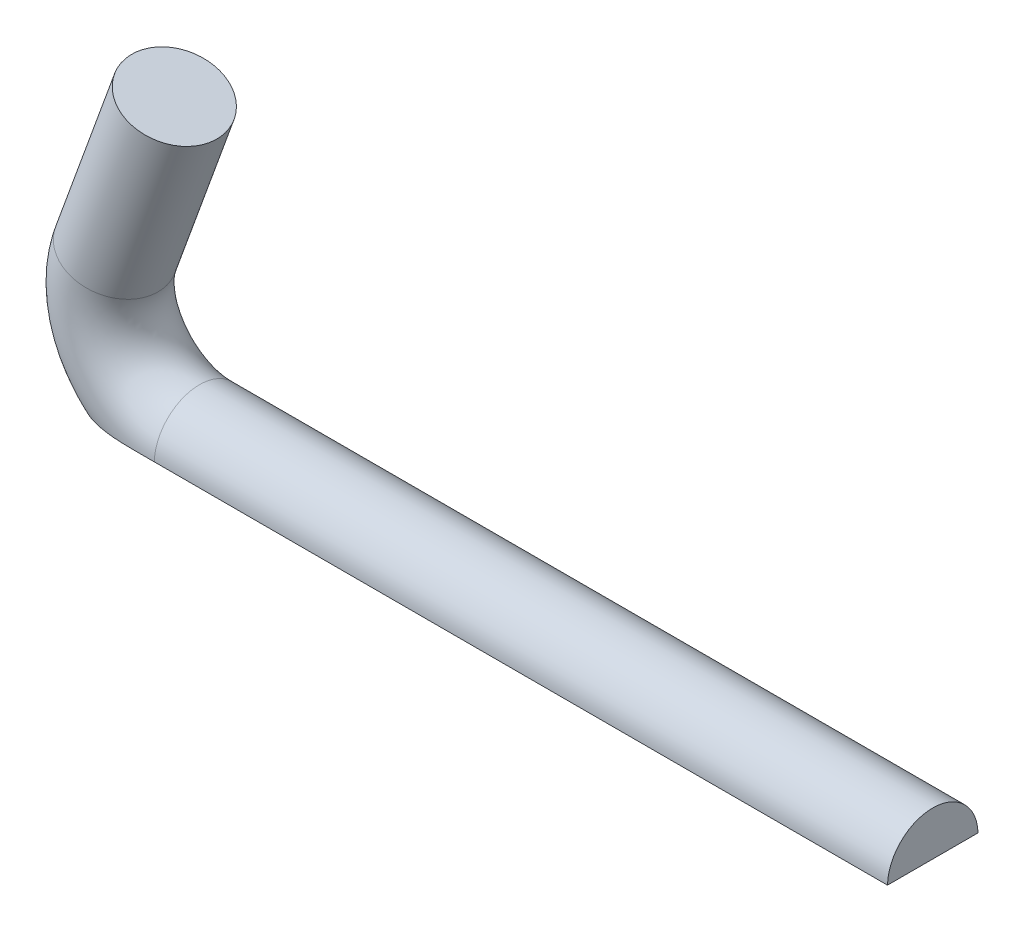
ISO-10303-21;
HEADER;
FILE_DESCRIPTION(('STEP AP214'),'2;1');
FILE_NAME('part.step','',(''),(''),'','','');
FILE_SCHEMA(('AUTOMOTIVE_DESIGN { 1 0 10303 214 1 1 1 1 }'));
ENDSEC;
DATA;
#1=APPLICATION_CONTEXT('core data for automotive mechanical design processes');
#2=APPLICATION_PROTOCOL_DEFINITION('international standard','automotive_design',2000,#1);
#3=PRODUCT_CONTEXT('',#1,'mechanical');
#4=PRODUCT('Part','Part','',(#3));
#5=PRODUCT_RELATED_PRODUCT_CATEGORY('part','',(#4));
#6=PRODUCT_DEFINITION_FORMATION('','',#4);
#7=PRODUCT_DEFINITION_CONTEXT('part definition',#1,'design');
#8=PRODUCT_DEFINITION('design','',#6,#7);
#9=PRODUCT_DEFINITION_SHAPE('','',#8);
#10=(LENGTH_UNIT() NAMED_UNIT(*) SI_UNIT(.MILLI.,.METRE.));
#11=(NAMED_UNIT(*) PLANE_ANGLE_UNIT() SI_UNIT($,.RADIAN.));
#12=(NAMED_UNIT(*) SI_UNIT($,.STERADIAN.) SOLID_ANGLE_UNIT());
#13=UNCERTAINTY_MEASURE_WITH_UNIT(LENGTH_MEASURE(1.E-05),#10,'distance_accuracy_value','');
#14=(GEOMETRIC_REPRESENTATION_CONTEXT(3) GLOBAL_UNCERTAINTY_ASSIGNED_CONTEXT((#13)) GLOBAL_UNIT_ASSIGNED_CONTEXT((#10,
#11,#12)) REPRESENTATION_CONTEXT('',''));
#15=CARTESIAN_POINT('',(0.,0.,0.));
#16=DIRECTION('',(0.,0.,1.));
#17=DIRECTION('',(1.,0.,0.));
#18=AXIS2_PLACEMENT_3D('',#15,#16,#17);
#19=CARTESIAN_POINT('',(0.,0.,0.));
#20=DIRECTION('',(1.,0.,0.));
#21=DIRECTION('',(0.,0.,-1.));
#22=AXIS2_PLACEMENT_3D('',#19,#20,#21);
#23=PLANE('',#22);
#24=DIRECTION('',(0.,0.,1.));
#25=VECTOR('',#24,1.);
#26=CARTESIAN_POINT('',(0.,0.0253999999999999,-1.1684));
#27=LINE('',#26,#25);
#28=CARTESIAN_POINT('',(0.,0.0253999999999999,-1.1681238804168));
#29=VERTEX_POINT('',#28);
#30=CARTESIAN_POINT('',(0.,0.0253999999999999,1.1681238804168));
#31=VERTEX_POINT('',#30);
#32=EDGE_CURVE('E71',#29,#31,#27,.T.);
#33=ORIENTED_EDGE('',*,*,#32,.F.);
#34=CARTESIAN_POINT('',(0.,0.,0.));
#35=DIRECTION('',(1.,0.,0.));
#36=DIRECTION('',(0.,0.,-1.));
#37=AXIS2_PLACEMENT_3D('',#34,#35,#36);
#38=CIRCLE('',#37,1.1684);
#39=EDGE_CURVE('E76',#29,#31,#38,.T.);
#40=ORIENTED_EDGE('',*,*,#39,.T.);
#41=EDGE_LOOP('',(#33,#40));
#42=FACE_BOUND('',#41,.T.);
#43=ADVANCED_FACE('F37',(#42),#23,.T.);
#44=CARTESIAN_POINT('',(-19.575369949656,7.27979873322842,0.));
#45=DIRECTION('',(-0.342020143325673,-0.939692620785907,0.));
#46=DIRECTION('',(0.,0.,-1.));
#47=AXIS2_PLACEMENT_3D('',#44,#45,#46);
#48=PLANE('',#47);
#49=CARTESIAN_POINT('',(-19.575369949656,7.27979873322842,0.));
#50=DIRECTION('',(-0.342020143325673,-0.939692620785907,0.));
#51=DIRECTION('',(0.,0.,-1.));
#52=AXIS2_PLACEMENT_3D('',#49,#50,#51);
#53=CIRCLE('',#52,1.1684);
#54=CARTESIAN_POINT('',(-19.575369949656,7.27979873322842,-1.1684));
#55=VERTEX_POINT('',#54);
#56=EDGE_CURVE('E49',#55,#55,#53,.T.);
#57=ORIENTED_EDGE('',*,*,#56,.F.);
#58=EDGE_LOOP('',(#57));
#59=FACE_BOUND('',#58,.T.);
#60=ADVANCED_FACE('F103',(#59),#48,.F.);
#61=CARTESIAN_POINT('',(0.,0.,0.));
#62=DIRECTION('',(-1.,0.,0.));
#63=DIRECTION('',(0.,-1.,0.));
#64=AXIS2_PLACEMENT_3D('',#61,#62,#63);
#65=CYLINDRICAL_SURFACE('',#64,1.1684);
#66=ORIENTED_EDGE('',*,*,#39,.F.);
#67=DIRECTION('',(-1.,0.,0.));
#68=VECTOR('',#67,1.);
#69=CARTESIAN_POINT('',(0.,0.0253999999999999,-1.1681238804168));
#70=LINE('',#69,#68);
#71=CARTESIAN_POINT('',(-18.9239786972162,0.0253999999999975,-1.1681238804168));
#72=VERTEX_POINT('',#71);
#73=EDGE_CURVE('E68',#29,#72,#70,.T.);
#74=ORIENTED_EDGE('',*,*,#73,.T.);
#75=CARTESIAN_POINT('',(-18.9239786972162,0.,0.));
#76=DIRECTION('',(1.,0.,0.));
#77=DIRECTION('',(0.,0.,-1.));
#78=AXIS2_PLACEMENT_3D('',#75,#76,#77);
#79=CIRCLE('',#78,1.1684);
#80=CARTESIAN_POINT('',(-18.9239786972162,0.0253999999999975,1.1681238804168));
#81=VERTEX_POINT('',#80);
#82=EDGE_CURVE('E83',#72,#81,#79,.T.);
#83=ORIENTED_EDGE('',*,*,#82,.T.);
#84=DIRECTION('',(-1.,0.,0.));
#85=VECTOR('',#84,1.);
#86=CARTESIAN_POINT('',(0.,0.0253999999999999,1.1681238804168));
#87=LINE('',#86,#85);
#88=EDGE_CURVE('E77',#81,#31,#87,.F.);
#89=ORIENTED_EDGE('',*,*,#88,.T.);
#90=EDGE_LOOP('',(#66,#74,#83,#89));
#91=FACE_BOUND('',#90,.T.);
#92=ADVANCED_FACE('F82',(#91),#65,.T.);
#93=CARTESIAN_POINT('',(-18.9239786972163,2.3114,0.));
#94=DIRECTION('',(0.,0.,-1.));
#95=DIRECTION('',(-1.,0.,0.));
#96=AXIS2_PLACEMENT_3D('',#93,#94,#95);
#97=TOROIDAL_SURFACE('',#96,2.3114,1.1684);
#98=CARTESIAN_POINT('',(-21.0959842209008,3.10194535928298,0.));
#99=DIRECTION('',(-0.342020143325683,-0.939692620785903,0.));
#100=DIRECTION('',(0.,0.,-1.));
#101=AXIS2_PLACEMENT_3D('',#98,#99,#100);
#102=CIRCLE('',#101,1.1684);
#103=CARTESIAN_POINT('',(-21.0959842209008,3.10194535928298,-1.1684));
#104=VERTEX_POINT('',#103);
#105=EDGE_CURVE('E85',#104,#104,#102,.T.);
#106=ORIENTED_EDGE('',*,*,#105,.T.);
#107=EDGE_LOOP('',(#106));
#108=FACE_BOUND('',#107,.T.);
#109=CARTESIAN_POINT('',(-21.5475663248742,0.0253999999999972,0.));
#110=CARTESIAN_POINT('',(-21.5475617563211,0.0253999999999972,0.0527999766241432));
#111=CARTESIAN_POINT('',(-21.5427870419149,0.0253999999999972,0.105663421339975));
#112=CARTESIAN_POINT('',(-21.5239475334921,0.0253999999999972,0.209757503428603));
#113=CARTESIAN_POINT('',(-21.5098658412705,0.0253999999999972,0.260984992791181));
#114=CARTESIAN_POINT('',(-21.4732770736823,0.0253999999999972,0.36007078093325));
#115=CARTESIAN_POINT('',(-21.4508056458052,0.0253999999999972,0.407942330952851));
#116=CARTESIAN_POINT('',(-21.3985605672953,0.0253999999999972,0.499460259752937));
#117=CARTESIAN_POINT('',(-21.3687884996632,0.0253999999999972,0.543107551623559));
#118=CARTESIAN_POINT('',(-21.3014399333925,0.0253999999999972,0.627748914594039));
#119=CARTESIAN_POINT('',(-21.263531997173,0.0253999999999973,0.668477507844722));
#120=CARTESIAN_POINT('',(-21.1824267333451,0.0253999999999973,0.744263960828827));
#121=CARTESIAN_POINT('',(-21.1392249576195,0.0253999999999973,0.779316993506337));
#122=CARTESIAN_POINT('',(-21.0227333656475,0.0253999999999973,0.862376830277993));
#123=CARTESIAN_POINT('',(-20.9464556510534,0.0253999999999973,0.906202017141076));
#124=CARTESIAN_POINT('',(-20.7880497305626,0.0253999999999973,0.981128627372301));
#125=CARTESIAN_POINT('',(-20.7059165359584,0.0253999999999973,1.01221904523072));
#126=CARTESIAN_POINT('',(-20.5306451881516,0.0253999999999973,1.06622481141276));
#127=CARTESIAN_POINT('',(-20.4371967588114,0.0253999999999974,1.08810187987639));
#128=CARTESIAN_POINT('',(-20.2485093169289,0.0253999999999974,1.12224845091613));
#129=CARTESIAN_POINT('',(-20.1532673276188,0.0253999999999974,1.13450021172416));
#130=CARTESIAN_POINT('',(-19.9615072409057,0.0253999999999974,1.15240707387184));
#131=CARTESIAN_POINT('',(-19.8649849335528,0.0253999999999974,1.15801185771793));
#132=CARTESIAN_POINT('',(-19.6718912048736,0.0253999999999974,1.16524995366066));
#133=CARTESIAN_POINT('',(-19.5753198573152,0.0253999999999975,1.16688586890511));
#134=CARTESIAN_POINT('',(-19.4079817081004,0.0253999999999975,1.16826550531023));
#135=CARTESIAN_POINT('',(-19.3372156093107,0.0253999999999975,1.16839805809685));
#136=CARTESIAN_POINT('',(-19.1956830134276,0.0253999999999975,1.16840193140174));
#137=CARTESIAN_POINT('',(-19.1249165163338,0.0253999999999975,1.16827325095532));
#138=CARTESIAN_POINT('',(-18.9833454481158,0.0253999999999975,1.168123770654));
#139=CARTESIAN_POINT('',(-18.9125408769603,0.0253999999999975,1.16810302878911));
#140=CARTESIAN_POINT('',(-18.7709321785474,0.0253999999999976,1.16820717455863));
#141=CARTESIAN_POINT('',(-18.7001280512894,0.0253999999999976,1.16833206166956));
#142=CARTESIAN_POINT('',(-18.5586114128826,0.0253999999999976,1.16843184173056));
#143=CARTESIAN_POINT('',(-18.4878989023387,0.0253999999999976,1.16840692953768));
#144=CARTESIAN_POINT('',(-18.3464724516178,0.0253999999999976,1.16761737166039));
#145=CARTESIAN_POINT('',(-18.2757585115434,0.0253999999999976,1.16685268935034));
#146=CARTESIAN_POINT('',(-18.1344279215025,0.0253999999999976,1.16375971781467));
#147=CARTESIAN_POINT('',(-18.0638112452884,0.0253999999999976,1.1614330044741));
#148=CARTESIAN_POINT('',(-17.9227124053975,0.0253999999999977,1.15422770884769));
#149=CARTESIAN_POINT('',(-17.8522302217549,0.0253999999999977,1.14934954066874));
#150=CARTESIAN_POINT('',(-17.7099750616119,0.0253999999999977,1.13576916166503));
#151=CARTESIAN_POINT('',(-17.6382091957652,0.0253999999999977,1.12698248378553));
#152=CARTESIAN_POINT('',(-17.4955011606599,0.0253999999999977,1.10432711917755));
#153=CARTESIAN_POINT('',(-17.4245593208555,0.0253999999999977,1.09045646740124));
#154=CARTESIAN_POINT('',(-17.2150488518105,0.0253999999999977,1.03941436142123));
#155=CARTESIAN_POINT('',(-17.0782930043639,0.0253999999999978,0.992727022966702));
#156=CARTESIAN_POINT('',(-16.8920633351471,0.0253999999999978,0.899859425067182));
#157=CARTESIAN_POINT('',(-16.8357366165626,0.0253999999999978,0.867348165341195));
#158=CARTESIAN_POINT('',(-16.7280938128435,0.0253999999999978,0.794595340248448));
#159=CARTESIAN_POINT('',(-16.6767852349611,0.0253999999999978,0.754342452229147));
#160=CARTESIAN_POINT('',(-16.5809280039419,0.0253999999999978,0.665614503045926));
#161=CARTESIAN_POINT('',(-16.5364405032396,0.0253999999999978,0.617072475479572));
#162=CARTESIAN_POINT('',(-16.4571958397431,0.0253999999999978,0.512589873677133));
#163=CARTESIAN_POINT('',(-16.4224268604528,0.0253999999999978,0.456658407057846));
#164=CARTESIAN_POINT('',(-16.3672585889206,0.0253999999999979,0.343599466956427));
#165=CARTESIAN_POINT('',(-16.3459295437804,0.0253999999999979,0.28692875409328));
#166=CARTESIAN_POINT('',(-16.3149567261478,0.0253999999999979,0.170472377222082));
#167=CARTESIAN_POINT('',(-16.3053035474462,0.0253999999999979,0.110689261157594));
#168=CARTESIAN_POINT('',(-16.2988919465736,0.0253999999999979,-0.000712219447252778));
#169=CARTESIAN_POINT('',(-16.3004475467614,0.0253999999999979,-0.0522398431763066));
#170=CARTESIAN_POINT('',(-16.312462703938,0.0253999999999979,-0.154231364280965));
#171=CARTESIAN_POINT('',(-16.3229195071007,0.0253999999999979,-0.204695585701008));
#172=CARTESIAN_POINT('',(-16.3517546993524,0.0253999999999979,-0.301752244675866));
#173=CARTESIAN_POINT('',(-16.3699047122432,0.0253999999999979,-0.348413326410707));
#174=CARTESIAN_POINT('',(-16.4132171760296,0.0253999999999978,-0.438336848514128));
#175=CARTESIAN_POINT('',(-16.4383806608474,0.0253999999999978,-0.481598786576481));
#176=CARTESIAN_POINT('',(-16.4969522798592,0.0253999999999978,-0.567311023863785));
#177=CARTESIAN_POINT('',(-16.5308593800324,0.0253999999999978,-0.609418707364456));
#178=CARTESIAN_POINT('',(-16.6043105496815,0.0253999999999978,-0.688369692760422));
#179=CARTESIAN_POINT('',(-16.6438585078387,0.0253999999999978,-0.725209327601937));
#180=CARTESIAN_POINT('',(-16.7484356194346,0.0253999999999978,-0.810758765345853));
#181=CARTESIAN_POINT('',(-16.8162497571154,0.0253999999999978,-0.856072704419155));
#182=CARTESIAN_POINT('',(-16.9582102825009,0.0253999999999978,-0.93521239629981));
#183=CARTESIAN_POINT('',(-17.0323667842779,0.0253999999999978,-0.969019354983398));
#184=CARTESIAN_POINT('',(-17.2313361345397,0.0253999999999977,-1.04440152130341));
#185=CARTESIAN_POINT('',(-17.3591624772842,0.0253999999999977,-1.07789073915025));
#186=CARTESIAN_POINT('',(-17.6182624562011,0.0253999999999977,-1.12642757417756));
#187=CARTESIAN_POINT('',(-17.7495480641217,0.0253999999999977,-1.14139912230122));
#188=CARTESIAN_POINT('',(-17.9800206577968,0.0253999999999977,-1.15811090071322));
#189=CARTESIAN_POINT('',(-18.0790721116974,0.0253999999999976,-1.16221543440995));
#190=CARTESIAN_POINT('',(-18.2772737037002,0.0253999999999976,-1.16714102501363));
#191=CARTESIAN_POINT('',(-18.376423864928,0.0253999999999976,-1.1679608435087));
#192=CARTESIAN_POINT('',(-18.5744799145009,0.0253999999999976,-1.16855606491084));
#193=CARTESIAN_POINT('',(-18.6733858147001,0.0253999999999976,-1.16833398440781));
#194=CARTESIAN_POINT('',(-18.8711787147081,0.0253999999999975,-1.16811077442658));
#195=CARTESIAN_POINT('',(-18.9700657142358,0.0253999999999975,-1.16810959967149));
#196=CARTESIAN_POINT('',(-19.1426669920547,0.0253999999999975,-1.1682930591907));
#197=CARTESIAN_POINT('',(-19.2163814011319,0.0253999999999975,-1.16843047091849));
#198=CARTESIAN_POINT('',(-19.3638096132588,0.0253999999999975,-1.16835760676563));
#199=CARTESIAN_POINT('',(-19.4375234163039,0.0253999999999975,-1.16814733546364));
#200=CARTESIAN_POINT('',(-19.5852228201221,0.0253999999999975,-1.16660853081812));
#201=CARTESIAN_POINT('',(-19.6592083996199,0.0253999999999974,-1.16527579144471));
#202=CARTESIAN_POINT('',(-19.8071095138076,0.0253999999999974,-1.16045526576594));
#203=CARTESIAN_POINT('',(-19.8810250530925,0.0253999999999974,-1.15696763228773));
#204=CARTESIAN_POINT('',(-20.0298655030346,0.0253999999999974,-1.14653758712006));
#205=CARTESIAN_POINT('',(-20.104787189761,0.0253999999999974,-1.13953969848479));
#206=CARTESIAN_POINT('',(-20.2540021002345,0.0253999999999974,-1.12069402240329));
#207=CARTESIAN_POINT('',(-20.3282950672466,0.0253999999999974,-1.10884434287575));
#208=CARTESIAN_POINT('',(-20.5484945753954,0.0253999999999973,-1.06390908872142));
#209=CARTESIAN_POINT('',(-20.6929835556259,0.0253999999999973,-1.02139954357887));
#210=CARTESIAN_POINT('',(-20.8914507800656,0.0253999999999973,-0.933509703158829));
#211=CARTESIAN_POINT('',(-20.9517493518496,0.0253999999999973,-0.902387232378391));
#212=CARTESIAN_POINT('',(-21.0675128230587,0.0253999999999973,-0.831926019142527));
#213=CARTESIAN_POINT('',(-21.1229736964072,0.0253999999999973,-0.792580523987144));
#214=CARTESIAN_POINT('',(-21.2273209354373,0.0253999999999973,-0.704919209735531));
#215=CARTESIAN_POINT('',(-21.2761382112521,0.0253999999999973,-0.65651997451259));
#216=CARTESIAN_POINT('',(-21.3638440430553,0.0253999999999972,-0.551396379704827));
#217=CARTESIAN_POINT('',(-21.4027472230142,0.0253999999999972,-0.494684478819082));
#218=CARTESIAN_POINT('',(-21.4600156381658,0.0253999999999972,-0.389012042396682));
#219=CARTESIAN_POINT('',(-21.481073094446,0.0253999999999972,-0.341501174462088));
#220=CARTESIAN_POINT('',(-21.5148999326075,0.0253999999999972,-0.243665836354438));
#221=CARTESIAN_POINT('',(-21.5276876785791,0.0253999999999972,-0.193347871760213));
#222=CARTESIAN_POINT('',(-21.5398492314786,0.0253999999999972,-0.118831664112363));
#223=CARTESIAN_POINT('',(-21.5427381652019,0.0253999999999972,-0.0951639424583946));
#224=CARTESIAN_POINT('',(-21.5465979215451,0.0253999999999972,-0.0476684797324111));
#225=CARTESIAN_POINT('',(-21.5475683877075,0.0253999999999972,-0.0238407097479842));
#226=CARTESIAN_POINT('',(-21.5475663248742,0.0253999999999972,0.));
#227=B_SPLINE_CURVE_WITH_KNOTS('',3,(#109,#110,#111,#112,#113,#114,#115,#116,#117,#118,#119,
#120,#121,#122,#123,#124,#125,#126,#127,#128,#129,#130,#131,#132,#133,#134,#135,#136,#137,#138,
#139,#140,#141,#142,#143,#144,#145,#146,#147,#148,#149,#150,#151,#152,#153,#154,#155,#156,#157,
#158,#159,#160,#161,#162,#163,#164,#165,#166,#167,#168,#169,#170,#171,#172,#173,#174,#175,#176,
#177,#178,#179,#180,#181,#182,#183,#184,#185,#186,#187,#188,#189,#190,#191,#192,#193,#194,#195,
#196,#197,#198,#199,#200,#201,#202,#203,#204,#205,#206,#207,#208,#209,#210,#211,#212,#213,#214,
#215,#216,#217,#218,#219,#220,#221,#222,#223,#224,#225,#226),.UNSPECIFIED.,.T.,.F.,(4,2,2,2,2,2,
2,2,2,2,2,2,2,2,2,2,2,2,2,2,2,2,2,2,2,2,2,2,2,2,2,2,2,2,2,2,2,2,2,2,2,2,2,2,2,2,2,2,2,2,2,2,2,2,
2,2,2,2,4),(0.,0.158300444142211,0.316889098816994,0.474811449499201,0.632699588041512,
0.799004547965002,0.965450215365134,1.22784885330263,1.49047378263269,1.77769375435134,
2.06544190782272,2.3553546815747,2.64507725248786,2.85737601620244,3.06967556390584,
3.28208915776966,3.49450198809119,3.70663857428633,3.91878566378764,4.13071904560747,
4.3426180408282,4.55933743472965,4.77614068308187,5.20527288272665,5.39986418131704,
5.59474227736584,5.79127648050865,5.98757067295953,6.16810108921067,6.34848597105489,
6.50237142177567,6.65620928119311,6.80576909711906,6.95535097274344,7.1169150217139,
7.27859099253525,7.5218831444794,7.7655707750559,8.15967870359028,8.55540027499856,
8.85272708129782,9.15016597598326,9.44688681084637,9.74354682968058,9.9646904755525,
10.1858312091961,10.4078042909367,10.6297616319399,10.8553429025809,11.0810122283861,
11.5285909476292,11.7316317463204,11.9348399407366,12.1400218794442,12.3448993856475,
12.5001526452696,12.6550599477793,12.7265238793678,12.79800108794),.UNSPECIFIED.);
#228=EDGE_CURVE('E11',#72,#81,#227,.T.);
#229=ORIENTED_EDGE('',*,*,#228,.T.);
#230=ORIENTED_EDGE('',*,*,#82,.F.);
#231=EDGE_LOOP('',(#229,#230));
#232=FACE_BOUND('',#231,.T.);
#233=ADVANCED_FACE('F92',(#108,#232),#97,.T.);
#234=CARTESIAN_POINT('',(-21.0959842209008,3.10194535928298,0.));
#235=DIRECTION('',(0.342020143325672,0.939692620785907,0.));
#236=DIRECTION('',(-0.939692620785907,0.342020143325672,0.));
#237=AXIS2_PLACEMENT_3D('',#234,#235,#236);
#238=CYLINDRICAL_SURFACE('',#237,1.1684);
#239=ORIENTED_EDGE('',*,*,#56,.T.);
#240=EDGE_LOOP('',(#239));
#241=FACE_BOUND('',#240,.T.);
#242=ORIENTED_EDGE('',*,*,#105,.F.);
#243=EDGE_LOOP('',(#242));
#244=FACE_BOUND('',#243,.T.);
#245=ADVANCED_FACE('F94',(#241,#244),#238,.T.);
#246=CARTESIAN_POINT('',(0.,0.0253999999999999,-1.1684));
#247=DIRECTION('',(0.,1.,0.));
#248=DIRECTION('',(-1.,0.,0.));
#249=AXIS2_PLACEMENT_3D('',#246,#247,#248);
#250=PLANE('',#249);
#251=ORIENTED_EDGE('',*,*,#32,.T.);
#252=ORIENTED_EDGE('',*,*,#88,.F.);
#253=ORIENTED_EDGE('',*,*,#228,.F.);
#254=ORIENTED_EDGE('',*,*,#73,.F.);
#255=EDGE_LOOP('',(#251,#252,#253,#254));
#256=FACE_BOUND('',#255,.T.);
#257=ADVANCED_FACE('F70',(#256),#250,.F.);
#258=CLOSED_SHELL('',(#43,#60,#92,#233,#245,#257));
#259=MANIFOLD_SOLID_BREP('B2',#258);
#260=ADVANCED_BREP_SHAPE_REPRESENTATION('',(#18,#259),#14);
#261=SHAPE_DEFINITION_REPRESENTATION(#9,#260);
ENDSEC;
END-ISO-10303-21;
